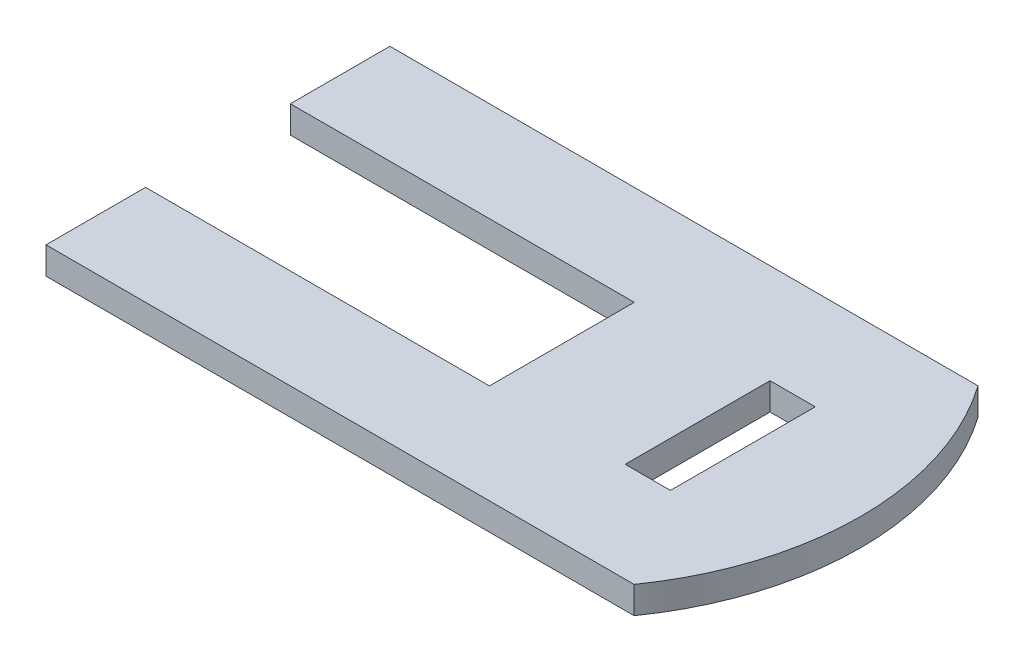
ISO-10303-21;
HEADER;
FILE_DESCRIPTION(('STEP AP214'),'2;1');
FILE_NAME('part.step','',(''),(''),'','','');
FILE_SCHEMA(('AUTOMOTIVE_DESIGN { 1 0 10303 214 1 1 1 1 }'));
ENDSEC;
DATA;
#1=APPLICATION_CONTEXT('core data for automotive mechanical design processes');
#2=APPLICATION_PROTOCOL_DEFINITION('international standard','automotive_design',2000,#1);
#3=PRODUCT_CONTEXT('',#1,'mechanical');
#4=PRODUCT('Part','Part','',(#3));
#5=PRODUCT_RELATED_PRODUCT_CATEGORY('part','',(#4));
#6=PRODUCT_DEFINITION_FORMATION('','',#4);
#7=PRODUCT_DEFINITION_CONTEXT('part definition',#1,'design');
#8=PRODUCT_DEFINITION('design','',#6,#7);
#9=PRODUCT_DEFINITION_SHAPE('','',#8);
#10=(LENGTH_UNIT() NAMED_UNIT(*) SI_UNIT(.MILLI.,.METRE.));
#11=(NAMED_UNIT(*) PLANE_ANGLE_UNIT() SI_UNIT($,.RADIAN.));
#12=(NAMED_UNIT(*) SI_UNIT($,.STERADIAN.) SOLID_ANGLE_UNIT());
#13=UNCERTAINTY_MEASURE_WITH_UNIT(LENGTH_MEASURE(1.E-05),#10,'distance_accuracy_value','');
#14=(GEOMETRIC_REPRESENTATION_CONTEXT(3) GLOBAL_UNCERTAINTY_ASSIGNED_CONTEXT((#13)) GLOBAL_UNIT_ASSIGNED_CONTEXT((#10,
#11,#12)) REPRESENTATION_CONTEXT('',''));
#15=CARTESIAN_POINT('',(0.,0.,0.));
#16=DIRECTION('',(0.,0.,1.));
#17=DIRECTION('',(1.,0.,0.));
#18=AXIS2_PLACEMENT_3D('',#15,#16,#17);
#19=CARTESIAN_POINT('',(38.,3.,-19.));
#20=DIRECTION('',(0.,1.,0.));
#21=DIRECTION('',(0.,0.,1.));
#22=AXIS2_PLACEMENT_3D('',#19,#20,#21);
#23=PLANE('',#22);
#24=DIRECTION('',(0.,0.,1.));
#25=VECTOR('',#24,1.);
#26=CARTESIAN_POINT('',(0.,3.,0.));
#27=LINE('',#26,#25);
#28=CARTESIAN_POINT('',(0.,3.,-11.));
#29=VERTEX_POINT('',#28);
#30=CARTESIAN_POINT('',(0.,3.,0.));
#31=VERTEX_POINT('',#30);
#32=EDGE_CURVE('E171',#29,#31,#27,.T.);
#33=ORIENTED_EDGE('',*,*,#32,.T.);
#34=DIRECTION('',(1.,0.,0.));
#35=VECTOR('',#34,1.);
#36=CARTESIAN_POINT('',(0.,3.,0.));
#37=LINE('',#36,#35);
#38=CARTESIAN_POINT('',(64.9814751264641,3.,0.));
#39=VERTEX_POINT('',#38);
#40=EDGE_CURVE('E174',#31,#39,#37,.T.);
#41=ORIENTED_EDGE('',*,*,#40,.T.);
#42=CARTESIAN_POINT('',(38.,3.,-19.));
#43=DIRECTION('',(0.,1.,0.));
#44=DIRECTION('',(0.,0.,1.));
#45=AXIS2_PLACEMENT_3D('',#42,#43,#44);
#46=CIRCLE('',#45,33.);
#47=CARTESIAN_POINT('',(64.9814751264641,3.,-38.));
#48=VERTEX_POINT('',#47);
#49=EDGE_CURVE('E176',#39,#48,#46,.T.);
#50=ORIENTED_EDGE('',*,*,#49,.T.);
#51=DIRECTION('',(-1.,0.,0.));
#52=VECTOR('',#51,1.);
#53=CARTESIAN_POINT('',(0.,3.,-38.));
#54=LINE('',#53,#52);
#55=CARTESIAN_POINT('',(0.,3.,-38.));
#56=VERTEX_POINT('',#55);
#57=EDGE_CURVE('E178',#48,#56,#54,.T.);
#58=ORIENTED_EDGE('',*,*,#57,.T.);
#59=DIRECTION('',(0.,0.,1.));
#60=VECTOR('',#59,1.);
#61=CARTESIAN_POINT('',(0.,3.,-27.));
#62=LINE('',#61,#60);
#63=CARTESIAN_POINT('',(0.,3.,-27.));
#64=VERTEX_POINT('',#63);
#65=EDGE_CURVE('E180',#56,#64,#62,.T.);
#66=ORIENTED_EDGE('',*,*,#65,.T.);
#67=DIRECTION('',(1.,0.,0.));
#68=VECTOR('',#67,1.);
#69=CARTESIAN_POINT('',(0.,3.,-27.));
#70=LINE('',#69,#68);
#71=CARTESIAN_POINT('',(38.,3.,-27.));
#72=VERTEX_POINT('',#71);
#73=EDGE_CURVE('E182',#64,#72,#70,.T.);
#74=ORIENTED_EDGE('',*,*,#73,.T.);
#75=DIRECTION('',(0.,0.,1.));
#76=VECTOR('',#75,1.);
#77=CARTESIAN_POINT('',(38.,3.,-11.));
#78=LINE('',#77,#76);
#79=CARTESIAN_POINT('',(38.,3.,-11.));
#80=VERTEX_POINT('',#79);
#81=EDGE_CURVE('E184',#72,#80,#78,.T.);
#82=ORIENTED_EDGE('',*,*,#81,.T.);
#83=DIRECTION('',(-1.,0.,0.));
#84=VECTOR('',#83,1.);
#85=CARTESIAN_POINT('',(0.,3.,-11.));
#86=LINE('',#85,#84);
#87=EDGE_CURVE('E186',#80,#29,#86,.T.);
#88=ORIENTED_EDGE('',*,*,#87,.T.);
#89=EDGE_LOOP('',(#33,#41,#50,#58,#66,#74,#82,#88));
#90=FACE_BOUND('',#89,.T.);
#91=DIRECTION('',(0.,0.,1.));
#92=VECTOR('',#91,1.);
#93=CARTESIAN_POINT('',(53.,3.,-11.));
#94=LINE('',#93,#92);
#95=CARTESIAN_POINT('',(53.,3.,-27.));
#96=VERTEX_POINT('',#95);
#97=CARTESIAN_POINT('',(53.,3.,-11.));
#98=VERTEX_POINT('',#97);
#99=EDGE_CURVE('E145',#96,#98,#94,.T.);
#100=ORIENTED_EDGE('',*,*,#99,.F.);
#101=DIRECTION('',(-1.,0.,0.));
#102=VECTOR('',#101,1.);
#103=CARTESIAN_POINT('',(53.,3.,-27.));
#104=LINE('',#103,#102);
#105=CARTESIAN_POINT('',(58.,3.,-27.));
#106=VERTEX_POINT('',#105);
#107=EDGE_CURVE('E134',#106,#96,#104,.T.);
#108=ORIENTED_EDGE('',*,*,#107,.F.);
#109=DIRECTION('',(0.,0.,-1.));
#110=VECTOR('',#109,1.);
#111=CARTESIAN_POINT('',(58.,3.,-11.));
#112=LINE('',#111,#110);
#113=CARTESIAN_POINT('',(58.,3.,-11.));
#114=VERTEX_POINT('',#113);
#115=EDGE_CURVE('E149',#114,#106,#112,.T.);
#116=ORIENTED_EDGE('',*,*,#115,.F.);
#117=DIRECTION('',(1.,0.,0.));
#118=VECTOR('',#117,1.);
#119=CARTESIAN_POINT('',(53.,3.,-11.));
#120=LINE('',#119,#118);
#121=EDGE_CURVE('E147',#98,#114,#120,.T.);
#122=ORIENTED_EDGE('',*,*,#121,.F.);
#123=EDGE_LOOP('',(#100,#108,#116,#122));
#124=FACE_BOUND('',#123,.T.);
#125=ADVANCED_FACE('F30',(#90,#124),#23,.T.);
#126=CARTESIAN_POINT('',(38.,0.,-19.));
#127=DIRECTION('',(0.,1.,0.));
#128=DIRECTION('',(0.,0.,1.));
#129=AXIS2_PLACEMENT_3D('',#126,#127,#128);
#130=PLANE('',#129);
#131=DIRECTION('',(0.,0.,1.));
#132=VECTOR('',#131,1.);
#133=CARTESIAN_POINT('',(0.,0.,0.));
#134=LINE('',#133,#132);
#135=CARTESIAN_POINT('',(0.,0.,-11.));
#136=VERTEX_POINT('',#135);
#137=CARTESIAN_POINT('',(0.,0.,0.));
#138=VERTEX_POINT('',#137);
#139=EDGE_CURVE('E135',#136,#138,#134,.T.);
#140=ORIENTED_EDGE('',*,*,#139,.F.);
#141=DIRECTION('',(-1.,0.,0.));
#142=VECTOR('',#141,1.);
#143=CARTESIAN_POINT('',(0.,0.,-11.));
#144=LINE('',#143,#142);
#145=CARTESIAN_POINT('',(38.,0.,-11.));
#146=VERTEX_POINT('',#145);
#147=EDGE_CURVE('E169',#146,#136,#144,.T.);
#148=ORIENTED_EDGE('',*,*,#147,.F.);
#149=DIRECTION('',(0.,0.,1.));
#150=VECTOR('',#149,1.);
#151=CARTESIAN_POINT('',(38.,0.,-11.));
#152=LINE('',#151,#150);
#153=CARTESIAN_POINT('',(38.,0.,-27.));
#154=VERTEX_POINT('',#153);
#155=EDGE_CURVE('E167',#154,#146,#152,.T.);
#156=ORIENTED_EDGE('',*,*,#155,.F.);
#157=DIRECTION('',(1.,0.,0.));
#158=VECTOR('',#157,1.);
#159=CARTESIAN_POINT('',(0.,0.,-27.));
#160=LINE('',#159,#158);
#161=CARTESIAN_POINT('',(0.,0.,-27.));
#162=VERTEX_POINT('',#161);
#163=EDGE_CURVE('E165',#162,#154,#160,.T.);
#164=ORIENTED_EDGE('',*,*,#163,.F.);
#165=DIRECTION('',(0.,0.,1.));
#166=VECTOR('',#165,1.);
#167=CARTESIAN_POINT('',(0.,0.,-27.));
#168=LINE('',#167,#166);
#169=CARTESIAN_POINT('',(0.,0.,-38.));
#170=VERTEX_POINT('',#169);
#171=EDGE_CURVE('E163',#170,#162,#168,.T.);
#172=ORIENTED_EDGE('',*,*,#171,.F.);
#173=DIRECTION('',(-1.,0.,0.));
#174=VECTOR('',#173,1.);
#175=CARTESIAN_POINT('',(0.,0.,-38.));
#176=LINE('',#175,#174);
#177=CARTESIAN_POINT('',(64.9814751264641,0.,-38.));
#178=VERTEX_POINT('',#177);
#179=EDGE_CURVE('E161',#178,#170,#176,.T.);
#180=ORIENTED_EDGE('',*,*,#179,.F.);
#181=CARTESIAN_POINT('',(38.,0.,-19.));
#182=DIRECTION('',(0.,1.,0.));
#183=DIRECTION('',(0.,0.,1.));
#184=AXIS2_PLACEMENT_3D('',#181,#182,#183);
#185=CIRCLE('',#184,33.);
#186=CARTESIAN_POINT('',(64.9814751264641,0.,0.));
#187=VERTEX_POINT('',#186);
#188=EDGE_CURVE('E159',#187,#178,#185,.T.);
#189=ORIENTED_EDGE('',*,*,#188,.F.);
#190=DIRECTION('',(1.,0.,0.));
#191=VECTOR('',#190,1.);
#192=CARTESIAN_POINT('',(0.,0.,0.));
#193=LINE('',#192,#191);
#194=EDGE_CURVE('E157',#138,#187,#193,.T.);
#195=ORIENTED_EDGE('',*,*,#194,.F.);
#196=EDGE_LOOP('',(#140,#148,#156,#164,#172,#180,#189,#195));
#197=FACE_BOUND('',#196,.T.);
#198=DIRECTION('',(-1.,0.,0.));
#199=VECTOR('',#198,1.);
#200=CARTESIAN_POINT('',(53.,0.,-27.));
#201=LINE('',#200,#199);
#202=CARTESIAN_POINT('',(58.,0.,-27.));
#203=VERTEX_POINT('',#202);
#204=CARTESIAN_POINT('',(53.,0.,-27.));
#205=VERTEX_POINT('',#204);
#206=EDGE_CURVE('E53',#203,#205,#201,.T.);
#207=ORIENTED_EDGE('',*,*,#206,.T.);
#208=DIRECTION('',(0.,0.,1.));
#209=VECTOR('',#208,1.);
#210=CARTESIAN_POINT('',(53.,0.,-11.));
#211=LINE('',#210,#209);
#212=CARTESIAN_POINT('',(53.,0.,-11.));
#213=VERTEX_POINT('',#212);
#214=EDGE_CURVE('E121',#205,#213,#211,.T.);
#215=ORIENTED_EDGE('',*,*,#214,.T.);
#216=DIRECTION('',(1.,0.,0.));
#217=VECTOR('',#216,1.);
#218=CARTESIAN_POINT('',(53.,0.,-11.));
#219=LINE('',#218,#217);
#220=CARTESIAN_POINT('',(58.,0.,-11.));
#221=VERTEX_POINT('',#220);
#222=EDGE_CURVE('E130',#213,#221,#219,.T.);
#223=ORIENTED_EDGE('',*,*,#222,.T.);
#224=DIRECTION('',(0.,0.,-1.));
#225=VECTOR('',#224,1.);
#226=CARTESIAN_POINT('',(58.,0.,-11.));
#227=LINE('',#226,#225);
#228=EDGE_CURVE('E139',#221,#203,#227,.T.);
#229=ORIENTED_EDGE('',*,*,#228,.T.);
#230=EDGE_LOOP('',(#207,#215,#223,#229));
#231=FACE_BOUND('',#230,.T.);
#232=ADVANCED_FACE('F138',(#197,#231),#130,.F.);
#233=CARTESIAN_POINT('',(0.,3.,0.));
#234=DIRECTION('',(1.,0.,0.));
#235=DIRECTION('',(0.,0.,-1.));
#236=AXIS2_PLACEMENT_3D('',#233,#234,#235);
#237=PLANE('',#236);
#238=ORIENTED_EDGE('',*,*,#139,.T.);
#239=DIRECTION('',(0.,-1.,0.));
#240=VECTOR('',#239,1.);
#241=CARTESIAN_POINT('',(0.,3.,0.));
#242=LINE('',#241,#240);
#243=EDGE_CURVE('E11',#31,#138,#242,.T.);
#244=ORIENTED_EDGE('',*,*,#243,.F.);
#245=ORIENTED_EDGE('',*,*,#32,.F.);
#246=DIRECTION('',(0.,-1.,0.));
#247=VECTOR('',#246,1.);
#248=CARTESIAN_POINT('',(0.,3.,-11.));
#249=LINE('',#248,#247);
#250=EDGE_CURVE('E188',#29,#136,#249,.T.);
#251=ORIENTED_EDGE('',*,*,#250,.T.);
#252=EDGE_LOOP('',(#238,#244,#245,#251));
#253=FACE_BOUND('',#252,.T.);
#254=ADVANCED_FACE('F32',(#253),#237,.F.);
#255=CARTESIAN_POINT('',(0.,3.,0.));
#256=DIRECTION('',(0.,0.,-1.));
#257=DIRECTION('',(-1.,0.,0.));
#258=AXIS2_PLACEMENT_3D('',#255,#256,#257);
#259=PLANE('',#258);
#260=ORIENTED_EDGE('',*,*,#194,.T.);
#261=DIRECTION('',(0.,-1.,0.));
#262=VECTOR('',#261,1.);
#263=CARTESIAN_POINT('',(64.9814751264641,3.,0.));
#264=LINE('',#263,#262);
#265=EDGE_CURVE('E38',#39,#187,#264,.T.);
#266=ORIENTED_EDGE('',*,*,#265,.F.);
#267=ORIENTED_EDGE('',*,*,#40,.F.);
#268=ORIENTED_EDGE('',*,*,#243,.T.);
#269=EDGE_LOOP('',(#260,#266,#267,#268));
#270=FACE_BOUND('',#269,.T.);
#271=ADVANCED_FACE('F232',(#270),#259,.F.);
#272=CARTESIAN_POINT('',(38.,3.,-19.));
#273=DIRECTION('',(0.,-1.,0.));
#274=DIRECTION('',(0.,0.,-1.));
#275=AXIS2_PLACEMENT_3D('',#272,#273,#274);
#276=CYLINDRICAL_SURFACE('',#275,33.);
#277=ORIENTED_EDGE('',*,*,#188,.T.);
#278=DIRECTION('',(0.,-1.,0.));
#279=VECTOR('',#278,1.);
#280=CARTESIAN_POINT('',(64.9814751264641,3.,-38.));
#281=LINE('',#280,#279);
#282=EDGE_CURVE('E203',#48,#178,#281,.T.);
#283=ORIENTED_EDGE('',*,*,#282,.F.);
#284=ORIENTED_EDGE('',*,*,#49,.F.);
#285=ORIENTED_EDGE('',*,*,#265,.T.);
#286=EDGE_LOOP('',(#277,#283,#284,#285));
#287=FACE_BOUND('',#286,.T.);
#288=ADVANCED_FACE('F210',(#287),#276,.T.);
#289=CARTESIAN_POINT('',(0.,3.,-38.));
#290=DIRECTION('',(0.,0.,1.));
#291=DIRECTION('',(1.,0.,0.));
#292=AXIS2_PLACEMENT_3D('',#289,#290,#291);
#293=PLANE('',#292);
#294=ORIENTED_EDGE('',*,*,#179,.T.);
#295=DIRECTION('',(0.,-1.,0.));
#296=VECTOR('',#295,1.);
#297=CARTESIAN_POINT('',(0.,3.,-38.));
#298=LINE('',#297,#296);
#299=EDGE_CURVE('E200',#56,#170,#298,.T.);
#300=ORIENTED_EDGE('',*,*,#299,.F.);
#301=ORIENTED_EDGE('',*,*,#57,.F.);
#302=ORIENTED_EDGE('',*,*,#282,.T.);
#303=EDGE_LOOP('',(#294,#300,#301,#302));
#304=FACE_BOUND('',#303,.T.);
#305=ADVANCED_FACE('F220',(#304),#293,.F.);
#306=CARTESIAN_POINT('',(0.,3.,-27.));
#307=DIRECTION('',(1.,0.,0.));
#308=DIRECTION('',(0.,0.,-1.));
#309=AXIS2_PLACEMENT_3D('',#306,#307,#308);
#310=PLANE('',#309);
#311=ORIENTED_EDGE('',*,*,#171,.T.);
#312=DIRECTION('',(0.,-1.,0.));
#313=VECTOR('',#312,1.);
#314=CARTESIAN_POINT('',(0.,3.,-27.));
#315=LINE('',#314,#313);
#316=EDGE_CURVE('E197',#64,#162,#315,.T.);
#317=ORIENTED_EDGE('',*,*,#316,.F.);
#318=ORIENTED_EDGE('',*,*,#65,.F.);
#319=ORIENTED_EDGE('',*,*,#299,.T.);
#320=EDGE_LOOP('',(#311,#317,#318,#319));
#321=FACE_BOUND('',#320,.T.);
#322=ADVANCED_FACE('F224',(#321),#310,.F.);
#323=CARTESIAN_POINT('',(0.,3.,-27.));
#324=DIRECTION('',(0.,0.,-1.));
#325=DIRECTION('',(-1.,0.,0.));
#326=AXIS2_PLACEMENT_3D('',#323,#324,#325);
#327=PLANE('',#326);
#328=ORIENTED_EDGE('',*,*,#163,.T.);
#329=DIRECTION('',(0.,-1.,0.));
#330=VECTOR('',#329,1.);
#331=CARTESIAN_POINT('',(38.,3.,-27.));
#332=LINE('',#331,#330);
#333=EDGE_CURVE('E194',#72,#154,#332,.T.);
#334=ORIENTED_EDGE('',*,*,#333,.F.);
#335=ORIENTED_EDGE('',*,*,#73,.F.);
#336=ORIENTED_EDGE('',*,*,#316,.T.);
#337=EDGE_LOOP('',(#328,#334,#335,#336));
#338=FACE_BOUND('',#337,.T.);
#339=ADVANCED_FACE('F245',(#338),#327,.F.);
#340=CARTESIAN_POINT('',(38.,3.,-11.));
#341=DIRECTION('',(1.,0.,0.));
#342=DIRECTION('',(0.,0.,-1.));
#343=AXIS2_PLACEMENT_3D('',#340,#341,#342);
#344=PLANE('',#343);
#345=ORIENTED_EDGE('',*,*,#155,.T.);
#346=DIRECTION('',(0.,-1.,0.));
#347=VECTOR('',#346,1.);
#348=CARTESIAN_POINT('',(38.,3.,-11.));
#349=LINE('',#348,#347);
#350=EDGE_CURVE('E191',#80,#146,#349,.T.);
#351=ORIENTED_EDGE('',*,*,#350,.F.);
#352=ORIENTED_EDGE('',*,*,#81,.F.);
#353=ORIENTED_EDGE('',*,*,#333,.T.);
#354=EDGE_LOOP('',(#345,#351,#352,#353));
#355=FACE_BOUND('',#354,.T.);
#356=ADVANCED_FACE('F243',(#355),#344,.F.);
#357=CARTESIAN_POINT('',(0.,3.,-11.));
#358=DIRECTION('',(0.,0.,1.));
#359=DIRECTION('',(1.,0.,0.));
#360=AXIS2_PLACEMENT_3D('',#357,#358,#359);
#361=PLANE('',#360);
#362=ORIENTED_EDGE('',*,*,#147,.T.);
#363=ORIENTED_EDGE('',*,*,#250,.F.);
#364=ORIENTED_EDGE('',*,*,#87,.F.);
#365=ORIENTED_EDGE('',*,*,#350,.T.);
#366=EDGE_LOOP('',(#362,#363,#364,#365));
#367=FACE_BOUND('',#366,.T.);
#368=ADVANCED_FACE('F238',(#367),#361,.F.);
#369=CARTESIAN_POINT('',(53.,3.,-27.));
#370=DIRECTION('',(0.,0.,1.));
#371=DIRECTION('',(1.,0.,0.));
#372=AXIS2_PLACEMENT_3D('',#369,#370,#371);
#373=PLANE('',#372);
#374=ORIENTED_EDGE('',*,*,#206,.F.);
#375=DIRECTION('',(0.,-1.,0.));
#376=VECTOR('',#375,1.);
#377=CARTESIAN_POINT('',(58.,3.,-27.));
#378=LINE('',#377,#376);
#379=EDGE_CURVE('E151',#106,#203,#378,.T.);
#380=ORIENTED_EDGE('',*,*,#379,.F.);
#381=ORIENTED_EDGE('',*,*,#107,.T.);
#382=DIRECTION('',(0.,-1.,0.));
#383=VECTOR('',#382,1.);
#384=CARTESIAN_POINT('',(53.,3.,-27.));
#385=LINE('',#384,#383);
#386=EDGE_CURVE('E123',#96,#205,#385,.T.);
#387=ORIENTED_EDGE('',*,*,#386,.T.);
#388=EDGE_LOOP('',(#374,#380,#381,#387));
#389=FACE_BOUND('',#388,.T.);
#390=ADVANCED_FACE('F132',(#389),#373,.T.);
#391=CARTESIAN_POINT('',(53.,3.,-11.));
#392=DIRECTION('',(1.,0.,0.));
#393=DIRECTION('',(0.,0.,-1.));
#394=AXIS2_PLACEMENT_3D('',#391,#392,#393);
#395=PLANE('',#394);
#396=ORIENTED_EDGE('',*,*,#214,.F.);
#397=ORIENTED_EDGE('',*,*,#386,.F.);
#398=ORIENTED_EDGE('',*,*,#99,.T.);
#399=DIRECTION('',(0.,-1.,0.));
#400=VECTOR('',#399,1.);
#401=CARTESIAN_POINT('',(53.,3.,-11.));
#402=LINE('',#401,#400);
#403=EDGE_CURVE('E126',#98,#213,#402,.T.);
#404=ORIENTED_EDGE('',*,*,#403,.T.);
#405=EDGE_LOOP('',(#396,#397,#398,#404));
#406=FACE_BOUND('',#405,.T.);
#407=ADVANCED_FACE('F122',(#406),#395,.T.);
#408=CARTESIAN_POINT('',(53.,3.,-11.));
#409=DIRECTION('',(0.,0.,-1.));
#410=DIRECTION('',(-1.,0.,0.));
#411=AXIS2_PLACEMENT_3D('',#408,#409,#410);
#412=PLANE('',#411);
#413=ORIENTED_EDGE('',*,*,#222,.F.);
#414=ORIENTED_EDGE('',*,*,#403,.F.);
#415=ORIENTED_EDGE('',*,*,#121,.T.);
#416=DIRECTION('',(0.,-1.,0.));
#417=VECTOR('',#416,1.);
#418=CARTESIAN_POINT('',(58.,3.,-11.));
#419=LINE('',#418,#417);
#420=EDGE_CURVE('E45',#114,#221,#419,.T.);
#421=ORIENTED_EDGE('',*,*,#420,.T.);
#422=EDGE_LOOP('',(#413,#414,#415,#421));
#423=FACE_BOUND('',#422,.T.);
#424=ADVANCED_FACE('F269',(#423),#412,.T.);
#425=CARTESIAN_POINT('',(58.,3.,-11.));
#426=DIRECTION('',(-1.,0.,0.));
#427=DIRECTION('',(0.,0.,1.));
#428=AXIS2_PLACEMENT_3D('',#425,#426,#427);
#429=PLANE('',#428);
#430=ORIENTED_EDGE('',*,*,#228,.F.);
#431=ORIENTED_EDGE('',*,*,#420,.F.);
#432=ORIENTED_EDGE('',*,*,#115,.T.);
#433=ORIENTED_EDGE('',*,*,#379,.T.);
#434=EDGE_LOOP('',(#430,#431,#432,#433));
#435=FACE_BOUND('',#434,.T.);
#436=ADVANCED_FACE('F274',(#435),#429,.T.);
#437=CLOSED_SHELL('',(#125,#232,#254,#271,#288,#305,#322,#339,#356,#368,#390,#407,#424,#436));
#438=MANIFOLD_SOLID_BREP('B2',#437);
#439=ADVANCED_BREP_SHAPE_REPRESENTATION('',(#18,#438),#14);
#440=SHAPE_DEFINITION_REPRESENTATION(#9,#439);
ENDSEC;
END-ISO-10303-21;
